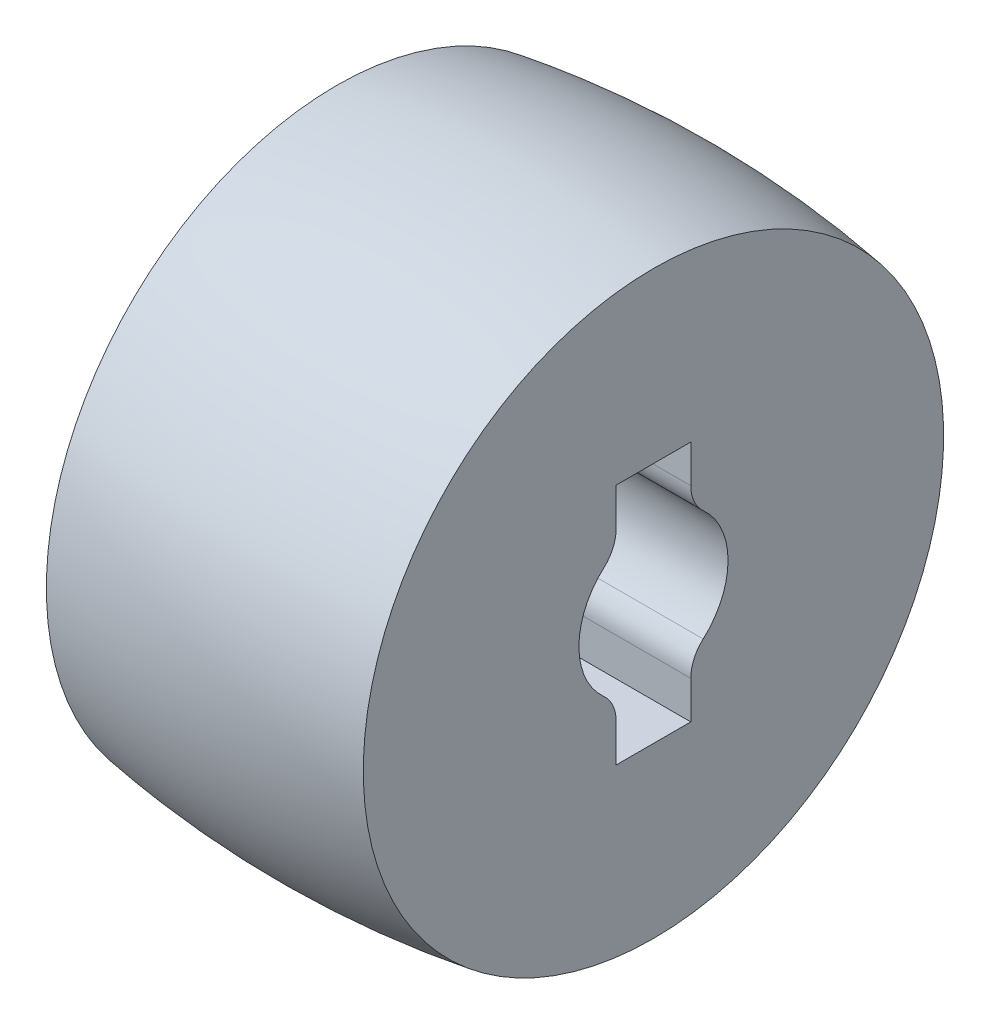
ISO-10303-21;
HEADER;
FILE_DESCRIPTION(('STEP AP214'),'2;1');
FILE_NAME('part.step','',(''),(''),'','','');
FILE_SCHEMA(('AUTOMOTIVE_DESIGN { 1 0 10303 214 1 1 1 1 }'));
ENDSEC;
DATA;
#1=APPLICATION_CONTEXT('core data for automotive mechanical design processes');
#2=APPLICATION_PROTOCOL_DEFINITION('international standard','automotive_design',2000,#1);
#3=PRODUCT_CONTEXT('',#1,'mechanical');
#4=PRODUCT('Part','Part','',(#3));
#5=PRODUCT_RELATED_PRODUCT_CATEGORY('part','',(#4));
#6=PRODUCT_DEFINITION_FORMATION('','',#4);
#7=PRODUCT_DEFINITION_CONTEXT('part definition',#1,'design');
#8=PRODUCT_DEFINITION('design','',#6,#7);
#9=PRODUCT_DEFINITION_SHAPE('','',#8);
#10=(LENGTH_UNIT() NAMED_UNIT(*) SI_UNIT(.MILLI.,.METRE.));
#11=(NAMED_UNIT(*) PLANE_ANGLE_UNIT() SI_UNIT($,.RADIAN.));
#12=(NAMED_UNIT(*) SI_UNIT($,.STERADIAN.) SOLID_ANGLE_UNIT());
#13=UNCERTAINTY_MEASURE_WITH_UNIT(LENGTH_MEASURE(1.E-05),#10,'distance_accuracy_value','');
#14=(GEOMETRIC_REPRESENTATION_CONTEXT(3) GLOBAL_UNCERTAINTY_ASSIGNED_CONTEXT((#13)) GLOBAL_UNIT_ASSIGNED_CONTEXT((#10,
#11,#12)) REPRESENTATION_CONTEXT('',''));
#15=CARTESIAN_POINT('',(0.,0.,0.));
#16=DIRECTION('',(0.,0.,1.));
#17=DIRECTION('',(1.,0.,0.));
#18=AXIS2_PLACEMENT_3D('',#15,#16,#17);
#19=CARTESIAN_POINT('',(4.25,0.,0.));
#20=DIRECTION('',(-1.,0.,0.));
#21=DIRECTION('',(0.,-1.,0.));
#22=AXIS2_PLACEMENT_3D('',#19,#20,#21);
#23=PLANE('',#22);
#24=CARTESIAN_POINT('',(4.25,0.,0.));
#25=DIRECTION('',(1.,0.,0.));
#26=DIRECTION('',(0.,1.,0.));
#27=AXIS2_PLACEMENT_3D('',#24,#25,#26);
#28=CIRCLE('',#27,7.7824534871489);
#29=CARTESIAN_POINT('',(4.25,7.7824534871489,0.));
#30=VERTEX_POINT('',#29);
#31=EDGE_CURVE('E174',#30,#30,#28,.T.);
#32=ORIENTED_EDGE('',*,*,#31,.T.);
#33=EDGE_LOOP('',(#32));
#34=FACE_BOUND('',#33,.T.);
#35=CARTESIAN_POINT('',(4.25,0.,0.));
#36=DIRECTION('',(-1.,0.,0.));
#37=DIRECTION('',(0.,0.,1.));
#38=AXIS2_PLACEMENT_3D('',#35,#36,#37);
#39=CIRCLE('',#38,2.);
#40=CARTESIAN_POINT('',(4.25,-1.49071198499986,1.33333333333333));
#41=VERTEX_POINT('',#40);
#42=CARTESIAN_POINT('',(4.25,1.49071198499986,1.33333333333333));
#43=VERTEX_POINT('',#42);
#44=EDGE_CURVE('E151',#41,#43,#39,.T.);
#45=ORIENTED_EDGE('',*,*,#44,.T.);
#46=CARTESIAN_POINT('',(4.25,2.23606797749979,2.));
#47=DIRECTION('',(-1.,0.,0.));
#48=DIRECTION('',(0.,-1.,0.));
#49=AXIS2_PLACEMENT_3D('',#46,#47,#48);
#50=CIRCLE('',#49,1.);
#51=CARTESIAN_POINT('',(4.25,2.23606797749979,1.));
#52=VERTEX_POINT('',#51);
#53=EDGE_CURVE('E150',#43,#52,#50,.F.);
#54=ORIENTED_EDGE('',*,*,#53,.T.);
#55=DIRECTION('',(0.,-1.,0.));
#56=VECTOR('',#55,1.);
#57=CARTESIAN_POINT('',(4.25,0.,1.));
#58=LINE('',#57,#56);
#59=CARTESIAN_POINT('',(4.25,3.25,1.));
#60=VERTEX_POINT('',#59);
#61=EDGE_CURVE('E137',#60,#52,#58,.T.);
#62=ORIENTED_EDGE('',*,*,#61,.F.);
#63=DIRECTION('',(0.,0.,1.));
#64=VECTOR('',#63,1.);
#65=CARTESIAN_POINT('',(4.25,3.25,0.));
#66=LINE('',#65,#64);
#67=CARTESIAN_POINT('',(4.25,3.25,-1.));
#68=VERTEX_POINT('',#67);
#69=EDGE_CURVE('E126',#68,#60,#66,.T.);
#70=ORIENTED_EDGE('',*,*,#69,.F.);
#71=DIRECTION('',(0.,-1.,0.));
#72=VECTOR('',#71,1.);
#73=CARTESIAN_POINT('',(4.25,0.,-1.));
#74=LINE('',#73,#72);
#75=CARTESIAN_POINT('',(4.25,2.23606797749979,-1.));
#76=VERTEX_POINT('',#75);
#77=EDGE_CURVE('E136',#68,#76,#74,.T.);
#78=ORIENTED_EDGE('',*,*,#77,.T.);
#79=CARTESIAN_POINT('',(4.25,2.23606797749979,-2.));
#80=DIRECTION('',(-1.,0.,0.));
#81=DIRECTION('',(0.,-1.,0.));
#82=AXIS2_PLACEMENT_3D('',#79,#80,#81);
#83=CIRCLE('',#82,1.);
#84=CARTESIAN_POINT('',(4.25,1.49071198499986,-1.33333333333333));
#85=VERTEX_POINT('',#84);
#86=EDGE_CURVE('E210',#76,#85,#83,.F.);
#87=ORIENTED_EDGE('',*,*,#86,.T.);
#88=CARTESIAN_POINT('',(4.25,0.,0.));
#89=DIRECTION('',(-1.,0.,0.));
#90=DIRECTION('',(0.,0.,1.));
#91=AXIS2_PLACEMENT_3D('',#88,#89,#90);
#92=CIRCLE('',#91,2.);
#93=CARTESIAN_POINT('',(4.25,-1.49071198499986,-1.33333333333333));
#94=VERTEX_POINT('',#93);
#95=EDGE_CURVE('E158',#85,#94,#92,.T.);
#96=ORIENTED_EDGE('',*,*,#95,.T.);
#97=CARTESIAN_POINT('',(4.25,-2.23606797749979,-2.));
#98=DIRECTION('',(-1.,0.,0.));
#99=DIRECTION('',(0.,-1.,0.));
#100=AXIS2_PLACEMENT_3D('',#97,#98,#99);
#101=CIRCLE('',#100,1.);
#102=CARTESIAN_POINT('',(4.25,-2.23606797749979,-1.));
#103=VERTEX_POINT('',#102);
#104=EDGE_CURVE('E52',#94,#103,#101,.F.);
#105=ORIENTED_EDGE('',*,*,#104,.T.);
#106=DIRECTION('',(0.,-1.,0.));
#107=VECTOR('',#106,1.);
#108=CARTESIAN_POINT('',(4.25,0.,-1.));
#109=LINE('',#108,#107);
#110=CARTESIAN_POINT('',(4.25,-3.25,-1.));
#111=VERTEX_POINT('',#110);
#112=EDGE_CURVE('E160',#103,#111,#109,.T.);
#113=ORIENTED_EDGE('',*,*,#112,.T.);
#114=DIRECTION('',(0.,0.,1.));
#115=VECTOR('',#114,1.);
#116=CARTESIAN_POINT('',(4.25,-3.25,0.));
#117=LINE('',#116,#115);
#118=CARTESIAN_POINT('',(4.25,-3.25,1.));
#119=VERTEX_POINT('',#118);
#120=EDGE_CURVE('E146',#111,#119,#117,.T.);
#121=ORIENTED_EDGE('',*,*,#120,.T.);
#122=DIRECTION('',(0.,-1.,0.));
#123=VECTOR('',#122,1.);
#124=CARTESIAN_POINT('',(4.25,0.,1.));
#125=LINE('',#124,#123);
#126=CARTESIAN_POINT('',(4.25,-2.23606797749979,1.));
#127=VERTEX_POINT('',#126);
#128=EDGE_CURVE('E153',#127,#119,#125,.T.);
#129=ORIENTED_EDGE('',*,*,#128,.F.);
#130=CARTESIAN_POINT('',(4.25,-2.23606797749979,2.));
#131=DIRECTION('',(-1.,0.,0.));
#132=DIRECTION('',(0.,-1.,0.));
#133=AXIS2_PLACEMENT_3D('',#130,#131,#132);
#134=CIRCLE('',#133,1.);
#135=EDGE_CURVE('E213',#127,#41,#134,.F.);
#136=ORIENTED_EDGE('',*,*,#135,.T.);
#137=EDGE_LOOP('',(#45,#54,#62,#70,#78,#87,#96,#105,#113,#121,#129,#136));
#138=FACE_BOUND('',#137,.T.);
#139=ADVANCED_FACE('F37',(#34,#138),#23,.F.);
#140=CARTESIAN_POINT('',(-4.25,0.,0.));
#141=DIRECTION('',(-1.,0.,0.));
#142=DIRECTION('',(0.,-1.,0.));
#143=AXIS2_PLACEMENT_3D('',#140,#141,#142);
#144=PLANE('',#143);
#145=CARTESIAN_POINT('',(-4.25,0.,0.));
#146=DIRECTION('',(1.,0.,0.));
#147=DIRECTION('',(0.,1.,0.));
#148=AXIS2_PLACEMENT_3D('',#145,#146,#147);
#149=CIRCLE('',#148,7.7824534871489);
#150=CARTESIAN_POINT('',(-4.25,7.7824534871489,0.));
#151=VERTEX_POINT('',#150);
#152=EDGE_CURVE('E167',#151,#151,#149,.T.);
#153=ORIENTED_EDGE('',*,*,#152,.F.);
#154=EDGE_LOOP('',(#153));
#155=FACE_BOUND('',#154,.T.);
#156=DIRECTION('',(0.,-1.,0.));
#157=VECTOR('',#156,1.);
#158=CARTESIAN_POINT('',(-4.25,0.,1.));
#159=LINE('',#158,#157);
#160=CARTESIAN_POINT('',(-4.25,3.25,1.));
#161=VERTEX_POINT('',#160);
#162=CARTESIAN_POINT('',(-4.25,2.23606797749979,1.));
#163=VERTEX_POINT('',#162);
#164=EDGE_CURVE('E145',#161,#163,#159,.T.);
#165=ORIENTED_EDGE('',*,*,#164,.T.);
#166=CARTESIAN_POINT('',(-4.25,2.23606797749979,2.));
#167=DIRECTION('',(-1.,0.,0.));
#168=DIRECTION('',(0.,-1.,0.));
#169=AXIS2_PLACEMENT_3D('',#166,#167,#168);
#170=CIRCLE('',#169,1.);
#171=CARTESIAN_POINT('',(-4.25,1.49071198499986,1.33333333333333));
#172=VERTEX_POINT('',#171);
#173=EDGE_CURVE('E203',#163,#172,#170,.T.);
#174=ORIENTED_EDGE('',*,*,#173,.T.);
#175=CARTESIAN_POINT('',(-4.25,0.,0.));
#176=DIRECTION('',(-1.,0.,0.));
#177=DIRECTION('',(0.,0.,1.));
#178=AXIS2_PLACEMENT_3D('',#175,#176,#177);
#179=CIRCLE('',#178,2.);
#180=CARTESIAN_POINT('',(-4.25,-1.49071198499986,1.33333333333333));
#181=VERTEX_POINT('',#180);
#182=EDGE_CURVE('E177',#181,#172,#179,.T.);
#183=ORIENTED_EDGE('',*,*,#182,.F.);
#184=CARTESIAN_POINT('',(-4.25,-2.23606797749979,2.));
#185=DIRECTION('',(-1.,0.,0.));
#186=DIRECTION('',(0.,-1.,0.));
#187=AXIS2_PLACEMENT_3D('',#184,#185,#186);
#188=CIRCLE('',#187,1.);
#189=CARTESIAN_POINT('',(-4.25,-2.23606797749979,1.));
#190=VERTEX_POINT('',#189);
#191=EDGE_CURVE('E201',#181,#190,#188,.T.);
#192=ORIENTED_EDGE('',*,*,#191,.T.);
#193=DIRECTION('',(0.,-1.,0.));
#194=VECTOR('',#193,1.);
#195=CARTESIAN_POINT('',(-4.25,0.,1.));
#196=LINE('',#195,#194);
#197=CARTESIAN_POINT('',(-4.25,-3.25,1.));
#198=VERTEX_POINT('',#197);
#199=EDGE_CURVE('E190',#190,#198,#196,.T.);
#200=ORIENTED_EDGE('',*,*,#199,.T.);
#201=DIRECTION('',(0.,0.,1.));
#202=VECTOR('',#201,1.);
#203=CARTESIAN_POINT('',(-4.25,-3.25,0.));
#204=LINE('',#203,#202);
#205=CARTESIAN_POINT('',(-4.25,-3.25,-1.));
#206=VERTEX_POINT('',#205);
#207=EDGE_CURVE('E187',#206,#198,#204,.T.);
#208=ORIENTED_EDGE('',*,*,#207,.F.);
#209=DIRECTION('',(0.,-1.,0.));
#210=VECTOR('',#209,1.);
#211=CARTESIAN_POINT('',(-4.25,0.,-1.));
#212=LINE('',#211,#210);
#213=CARTESIAN_POINT('',(-4.25,-2.23606797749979,-1.));
#214=VERTEX_POINT('',#213);
#215=EDGE_CURVE('E185',#214,#206,#212,.T.);
#216=ORIENTED_EDGE('',*,*,#215,.F.);
#217=CARTESIAN_POINT('',(-4.25,-2.23606797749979,-2.));
#218=DIRECTION('',(-1.,0.,0.));
#219=DIRECTION('',(0.,-1.,0.));
#220=AXIS2_PLACEMENT_3D('',#217,#218,#219);
#221=CIRCLE('',#220,1.);
#222=CARTESIAN_POINT('',(-4.25,-1.49071198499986,-1.33333333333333));
#223=VERTEX_POINT('',#222);
#224=EDGE_CURVE('E199',#214,#223,#221,.T.);
#225=ORIENTED_EDGE('',*,*,#224,.T.);
#226=CARTESIAN_POINT('',(-4.25,0.,0.));
#227=DIRECTION('',(-1.,0.,0.));
#228=DIRECTION('',(0.,0.,1.));
#229=AXIS2_PLACEMENT_3D('',#226,#227,#228);
#230=CIRCLE('',#229,2.);
#231=CARTESIAN_POINT('',(-4.25,1.49071198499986,-1.33333333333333));
#232=VERTEX_POINT('',#231);
#233=EDGE_CURVE('E184',#232,#223,#230,.T.);
#234=ORIENTED_EDGE('',*,*,#233,.F.);
#235=CARTESIAN_POINT('',(-4.25,2.23606797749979,-2.));
#236=DIRECTION('',(-1.,0.,0.));
#237=DIRECTION('',(0.,-1.,0.));
#238=AXIS2_PLACEMENT_3D('',#235,#236,#237);
#239=CIRCLE('',#238,1.);
#240=CARTESIAN_POINT('',(-4.25,2.23606797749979,-1.));
#241=VERTEX_POINT('',#240);
#242=EDGE_CURVE('E197',#232,#241,#239,.T.);
#243=ORIENTED_EDGE('',*,*,#242,.T.);
#244=DIRECTION('',(0.,-1.,0.));
#245=VECTOR('',#244,1.);
#246=CARTESIAN_POINT('',(-4.25,0.,-1.));
#247=LINE('',#246,#245);
#248=CARTESIAN_POINT('',(-4.25,3.25,-1.));
#249=VERTEX_POINT('',#248);
#250=EDGE_CURVE('E181',#249,#241,#247,.T.);
#251=ORIENTED_EDGE('',*,*,#250,.F.);
#252=DIRECTION('',(0.,0.,1.));
#253=VECTOR('',#252,1.);
#254=CARTESIAN_POINT('',(-4.25000000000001,3.25,0.));
#255=LINE('',#254,#253);
#256=EDGE_CURVE('E179',#249,#161,#255,.T.);
#257=ORIENTED_EDGE('',*,*,#256,.T.);
#258=EDGE_LOOP('',(#165,#174,#183,#192,#200,#208,#216,#225,#234,#243,#251,#257));
#259=FACE_BOUND('',#258,.T.);
#260=ADVANCED_FACE('F229',(#155,#259),#144,.T.);
#261=CARTESIAN_POINT('',(0.,0.,0.));
#262=DIRECTION('',(1.,0.,0.));
#263=DIRECTION('',(0.,1.,0.));
#264=AXIS2_PLACEMENT_3D('',#261,#262,#263);
#265=DEGENERATE_TOROIDAL_SURFACE('',#264,19.3871526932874,27.5,.F.);
#266=ORIENTED_EDGE('',*,*,#152,.T.);
#267=EDGE_LOOP('',(#266));
#268=FACE_BOUND('',#267,.T.);
#269=ORIENTED_EDGE('',*,*,#31,.F.);
#270=EDGE_LOOP('',(#269));
#271=FACE_BOUND('',#270,.T.);
#272=ADVANCED_FACE('F272',(#268,#271),#265,.F.);
#273=CARTESIAN_POINT('',(4.25,0.,1.));
#274=DIRECTION('',(0.,0.,-1.));
#275=DIRECTION('',(0.,1.,0.));
#276=AXIS2_PLACEMENT_3D('',#273,#274,#275);
#277=PLANE('',#276);
#278=ORIENTED_EDGE('',*,*,#199,.F.);
#279=DIRECTION('',(1.,0.,0.));
#280=VECTOR('',#279,1.);
#281=CARTESIAN_POINT('',(4.25,-2.23606797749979,1.));
#282=LINE('',#281,#280);
#283=EDGE_CURVE('E216',#190,#127,#282,.T.);
#284=ORIENTED_EDGE('',*,*,#283,.T.);
#285=ORIENTED_EDGE('',*,*,#128,.T.);
#286=DIRECTION('',(-1.,0.,0.));
#287=VECTOR('',#286,1.);
#288=CARTESIAN_POINT('',(4.25,-3.25,1.));
#289=LINE('',#288,#287);
#290=EDGE_CURVE('E164',#119,#198,#289,.T.);
#291=ORIENTED_EDGE('',*,*,#290,.T.);
#292=EDGE_LOOP('',(#278,#284,#285,#291));
#293=FACE_BOUND('',#292,.T.);
#294=ADVANCED_FACE('F247',(#293),#277,.T.);
#295=CARTESIAN_POINT('',(4.25,-3.25,0.));
#296=DIRECTION('',(0.,-1.,0.));
#297=DIRECTION('',(0.,0.,-1.));
#298=AXIS2_PLACEMENT_3D('',#295,#296,#297);
#299=PLANE('',#298);
#300=ORIENTED_EDGE('',*,*,#207,.T.);
#301=ORIENTED_EDGE('',*,*,#290,.F.);
#302=ORIENTED_EDGE('',*,*,#120,.F.);
#303=DIRECTION('',(-1.,0.,0.));
#304=VECTOR('',#303,1.);
#305=CARTESIAN_POINT('',(4.25,-3.25,-1.));
#306=LINE('',#305,#304);
#307=EDGE_CURVE('E168',#111,#206,#306,.T.);
#308=ORIENTED_EDGE('',*,*,#307,.T.);
#309=EDGE_LOOP('',(#300,#301,#302,#308));
#310=FACE_BOUND('',#309,.T.);
#311=ADVANCED_FACE('F244',(#310),#299,.F.);
#312=CARTESIAN_POINT('',(4.25,0.,-1.));
#313=DIRECTION('',(0.,0.,-1.));
#314=DIRECTION('',(0.,1.,0.));
#315=AXIS2_PLACEMENT_3D('',#312,#313,#314);
#316=PLANE('',#315);
#317=ORIENTED_EDGE('',*,*,#112,.F.);
#318=DIRECTION('',(-1.,0.,0.));
#319=VECTOR('',#318,1.);
#320=CARTESIAN_POINT('',(4.25,-2.23606797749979,-1.));
#321=LINE('',#320,#319);
#322=EDGE_CURVE('E218',#103,#214,#321,.T.);
#323=ORIENTED_EDGE('',*,*,#322,.T.);
#324=ORIENTED_EDGE('',*,*,#215,.T.);
#325=ORIENTED_EDGE('',*,*,#307,.F.);
#326=EDGE_LOOP('',(#317,#323,#324,#325));
#327=FACE_BOUND('',#326,.T.);
#328=ADVANCED_FACE('F237',(#327),#316,.F.);
#329=CARTESIAN_POINT('',(4.25,0.,0.));
#330=DIRECTION('',(-1.,0.,0.));
#331=DIRECTION('',(0.,0.,1.));
#332=AXIS2_PLACEMENT_3D('',#329,#330,#331);
#333=CYLINDRICAL_SURFACE('',#332,2.);
#334=ORIENTED_EDGE('',*,*,#233,.T.);
#335=DIRECTION('',(-1.,0.,0.));
#336=VECTOR('',#335,1.);
#337=CARTESIAN_POINT('',(4.25,-1.49071198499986,-1.33333333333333));
#338=LINE('',#337,#336);
#339=EDGE_CURVE('E45',#223,#94,#338,.F.);
#340=ORIENTED_EDGE('',*,*,#339,.T.);
#341=ORIENTED_EDGE('',*,*,#95,.F.);
#342=DIRECTION('',(-1.,0.,0.));
#343=VECTOR('',#342,1.);
#344=CARTESIAN_POINT('',(4.25,1.49071198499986,-1.33333333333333));
#345=LINE('',#344,#343);
#346=EDGE_CURVE('E221',#85,#232,#345,.T.);
#347=ORIENTED_EDGE('',*,*,#346,.T.);
#348=EDGE_LOOP('',(#334,#340,#341,#347));
#349=FACE_BOUND('',#348,.T.);
#350=ADVANCED_FACE('F225',(#349),#333,.F.);
#351=CARTESIAN_POINT('',(4.25,0.,-1.));
#352=DIRECTION('',(0.,0.,-1.));
#353=DIRECTION('',(0.,1.,0.));
#354=AXIS2_PLACEMENT_3D('',#351,#352,#353);
#355=PLANE('',#354);
#356=ORIENTED_EDGE('',*,*,#250,.T.);
#357=DIRECTION('',(-1.,0.,0.));
#358=VECTOR('',#357,1.);
#359=CARTESIAN_POINT('',(4.25,2.23606797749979,-1.));
#360=LINE('',#359,#358);
#361=EDGE_CURVE('E11',#241,#76,#360,.F.);
#362=ORIENTED_EDGE('',*,*,#361,.T.);
#363=ORIENTED_EDGE('',*,*,#77,.F.);
#364=DIRECTION('',(-1.,0.,0.));
#365=VECTOR('',#364,1.);
#366=CARTESIAN_POINT('',(4.25,3.25,-1.));
#367=LINE('',#366,#365);
#368=EDGE_CURVE('E132',#68,#249,#367,.T.);
#369=ORIENTED_EDGE('',*,*,#368,.T.);
#370=EDGE_LOOP('',(#356,#362,#363,#369));
#371=FACE_BOUND('',#370,.T.);
#372=ADVANCED_FACE('F260',(#371),#355,.F.);
#373=CARTESIAN_POINT('',(4.25,3.25,0.));
#374=DIRECTION('',(0.,-1.,0.));
#375=DIRECTION('',(0.,0.,-1.));
#376=AXIS2_PLACEMENT_3D('',#373,#374,#375);
#377=PLANE('',#376);
#378=ORIENTED_EDGE('',*,*,#368,.F.);
#379=ORIENTED_EDGE('',*,*,#69,.T.);
#380=DIRECTION('',(-1.,0.,0.));
#381=VECTOR('',#380,1.);
#382=CARTESIAN_POINT('',(4.25,3.25,1.));
#383=LINE('',#382,#381);
#384=EDGE_CURVE('E129',#60,#161,#383,.T.);
#385=ORIENTED_EDGE('',*,*,#384,.T.);
#386=ORIENTED_EDGE('',*,*,#256,.F.);
#387=EDGE_LOOP('',(#378,#379,#385,#386));
#388=FACE_BOUND('',#387,.T.);
#389=ADVANCED_FACE('F128',(#388),#377,.T.);
#390=CARTESIAN_POINT('',(4.25,0.,1.));
#391=DIRECTION('',(0.,0.,-1.));
#392=DIRECTION('',(0.,1.,0.));
#393=AXIS2_PLACEMENT_3D('',#390,#391,#392);
#394=PLANE('',#393);
#395=ORIENTED_EDGE('',*,*,#61,.T.);
#396=DIRECTION('',(1.,0.,0.));
#397=VECTOR('',#396,1.);
#398=CARTESIAN_POINT('',(-4.25,2.23606797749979,1.));
#399=LINE('',#398,#397);
#400=EDGE_CURVE('E192',#52,#163,#399,.F.);
#401=ORIENTED_EDGE('',*,*,#400,.T.);
#402=ORIENTED_EDGE('',*,*,#164,.F.);
#403=ORIENTED_EDGE('',*,*,#384,.F.);
#404=EDGE_LOOP('',(#395,#401,#402,#403));
#405=FACE_BOUND('',#404,.T.);
#406=ADVANCED_FACE('F141',(#405),#394,.T.);
#407=CARTESIAN_POINT('',(4.25,0.,0.));
#408=DIRECTION('',(-1.,0.,0.));
#409=DIRECTION('',(0.,0.,1.));
#410=AXIS2_PLACEMENT_3D('',#407,#408,#409);
#411=CYLINDRICAL_SURFACE('',#410,2.);
#412=ORIENTED_EDGE('',*,*,#182,.T.);
#413=DIRECTION('',(-1.,0.,0.));
#414=VECTOR('',#413,1.);
#415=CARTESIAN_POINT('',(4.25,1.49071198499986,1.33333333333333));
#416=LINE('',#415,#414);
#417=EDGE_CURVE('E208',#172,#43,#416,.F.);
#418=ORIENTED_EDGE('',*,*,#417,.T.);
#419=ORIENTED_EDGE('',*,*,#44,.F.);
#420=DIRECTION('',(-1.,0.,0.));
#421=VECTOR('',#420,1.);
#422=CARTESIAN_POINT('',(4.25,-1.49071198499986,1.33333333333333));
#423=LINE('',#422,#421);
#424=EDGE_CURVE('E205',#41,#181,#423,.T.);
#425=ORIENTED_EDGE('',*,*,#424,.T.);
#426=EDGE_LOOP('',(#412,#418,#419,#425));
#427=FACE_BOUND('',#426,.T.);
#428=ADVANCED_FACE('F254',(#427),#411,.F.);
#429=CARTESIAN_POINT('',(4.25,2.23606797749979,2.));
#430=DIRECTION('',(-1.,0.,0.));
#431=DIRECTION('',(0.,0.,1.));
#432=AXIS2_PLACEMENT_3D('',#429,#430,#431);
#433=CYLINDRICAL_SURFACE('',#432,1.);
#434=ORIENTED_EDGE('',*,*,#53,.F.);
#435=ORIENTED_EDGE('',*,*,#417,.F.);
#436=ORIENTED_EDGE('',*,*,#173,.F.);
#437=ORIENTED_EDGE('',*,*,#400,.F.);
#438=EDGE_LOOP('',(#434,#435,#436,#437));
#439=FACE_BOUND('',#438,.T.);
#440=ADVANCED_FACE('F258',(#439),#433,.T.);
#441=CARTESIAN_POINT('',(4.25,-2.23606797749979,2.));
#442=DIRECTION('',(-1.,0.,0.));
#443=DIRECTION('',(0.,0.,1.));
#444=AXIS2_PLACEMENT_3D('',#441,#442,#443);
#445=CYLINDRICAL_SURFACE('',#444,1.);
#446=ORIENTED_EDGE('',*,*,#135,.F.);
#447=ORIENTED_EDGE('',*,*,#283,.F.);
#448=ORIENTED_EDGE('',*,*,#191,.F.);
#449=ORIENTED_EDGE('',*,*,#424,.F.);
#450=EDGE_LOOP('',(#446,#447,#448,#449));
#451=FACE_BOUND('',#450,.T.);
#452=ADVANCED_FACE('F250',(#451),#445,.T.);
#453=CARTESIAN_POINT('',(4.25,-2.23606797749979,-2.));
#454=DIRECTION('',(-1.,0.,0.));
#455=DIRECTION('',(0.,0.,1.));
#456=AXIS2_PLACEMENT_3D('',#453,#454,#455);
#457=CYLINDRICAL_SURFACE('',#456,1.);
#458=ORIENTED_EDGE('',*,*,#104,.F.);
#459=ORIENTED_EDGE('',*,*,#339,.F.);
#460=ORIENTED_EDGE('',*,*,#224,.F.);
#461=ORIENTED_EDGE('',*,*,#322,.F.);
#462=EDGE_LOOP('',(#458,#459,#460,#461));
#463=FACE_BOUND('',#462,.T.);
#464=ADVANCED_FACE('F235',(#463),#457,.T.);
#465=CARTESIAN_POINT('',(4.25,2.23606797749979,-2.));
#466=DIRECTION('',(-1.,0.,0.));
#467=DIRECTION('',(0.,0.,1.));
#468=AXIS2_PLACEMENT_3D('',#465,#466,#467);
#469=CYLINDRICAL_SURFACE('',#468,1.);
#470=ORIENTED_EDGE('',*,*,#86,.F.);
#471=ORIENTED_EDGE('',*,*,#361,.F.);
#472=ORIENTED_EDGE('',*,*,#242,.F.);
#473=ORIENTED_EDGE('',*,*,#346,.F.);
#474=EDGE_LOOP('',(#470,#471,#472,#473));
#475=FACE_BOUND('',#474,.T.);
#476=ADVANCED_FACE('F39',(#475),#469,.T.);
#477=CLOSED_SHELL('',(#139,#260,#272,#294,#311,#328,#350,#372,#389,#406,#428,#440,#452,#464,#476));
#478=MANIFOLD_SOLID_BREP('B2',#477);
#479=ADVANCED_BREP_SHAPE_REPRESENTATION('',(#18,#478),#14);
#480=SHAPE_DEFINITION_REPRESENTATION(#9,#479);
ENDSEC;
END-ISO-10303-21;
